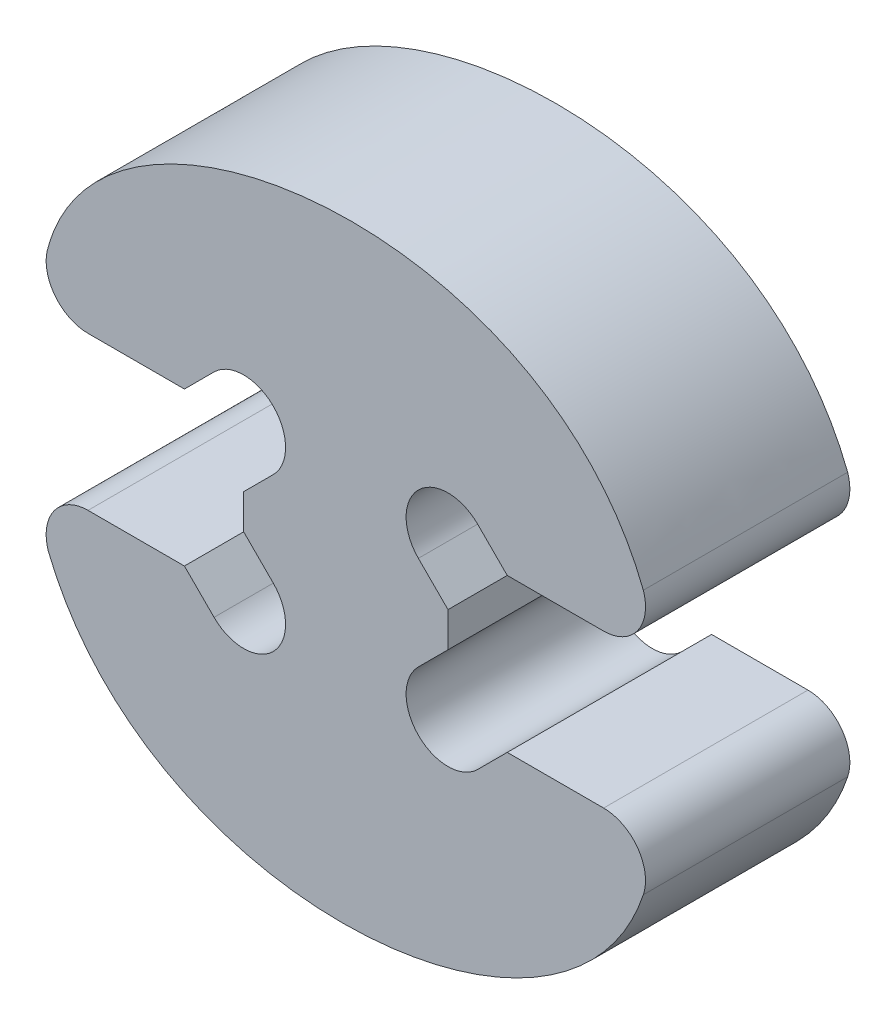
from build123d import *

# Parameters (mm, degrees)
BOSS_EXTRUDE1_DEPTH = 20


with BuildPart() as part:
    # Sketch2 → Boss-Extrude1 (new body)
    with BuildSketch(Plane.XY):
        with BuildLine():
            Line((533.79568, 187.641), (543.232196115, 187.641))
            ThreePointArc((543.232196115, 187.641), (546.561858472, 185.933351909), (547.117915, 182.232877))
            add(Edge.make_bspline(
                [(488.876985, 182.232907), (498.801346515, 157.679524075), (540.107475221, 161.211357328), (547.117915, 182.232877)],
                knots=[0, 0, 0, 0, 1, 1, 1, 1], degree=3))
            ThreePointArc((488.876985, 182.232907), (489.433064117, 185.933366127), (492.76272, 187.641))
            Line((492.76272, 187.641), (502.19912, 187.641))
            Line((502.19912, 187.641), (505.09826, 184.74186))
            ThreePointArc((505.09826, 184.74186), (510.89654, 184.74186), (510.89654, 190.54014))
            Line((510.89654, 190.54014), (507.9974, 193.43928))
            Line((507.9974, 193.43928), (507.9974, 196.84272))
            Line((507.9974, 196.84272), (510.89654, 199.74186))
            ThreePointArc((510.89654, 199.74186), (510.89654, 205.54014), (505.09826, 205.54014))
            Line((505.09826, 205.54014), (502.19912, 202.641))
            Line((502.19912, 202.641), (492.762713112, 202.641))
            ThreePointArc((492.762713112, 202.641), (489.433062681, 204.348632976), (488.876985, 208.049087))
            add(Edge.make_bspline(
                [(488.876985, 208.049087), (494.46237608, 228.041735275), (537.29933382, 233.210188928), (547.117913, 208.049117)],
                knots=[0, 0, 0, 0, 1, 1, 1, 1], degree=3))
            ThreePointArc((547.117913, 208.049117), (546.561855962, 204.348647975), (543.2322, 202.641))
            Line((543.2322, 202.641), (533.79568, 202.641))
            Line((533.79568, 202.641), (530.89654, 205.54014))
            ThreePointArc((530.89654, 205.54014), (525.09826, 205.54014), (525.09826, 199.74186))
            Line((525.09826, 199.74186), (527.9974, 196.84272))
            Line((527.9974, 196.84272), (527.9974, 193.43928))
            Line((527.9974, 193.43928), (525.09826, 190.54014))
            ThreePointArc((525.09826, 190.54014), (525.09826, 184.74186), (530.89654, 184.74186))
            Line((530.89654, 184.74186), (533.79568, 187.641))
        make_face()
    extrude(amount=BOSS_EXTRUDE1_DEPTH)


solid = part.part
